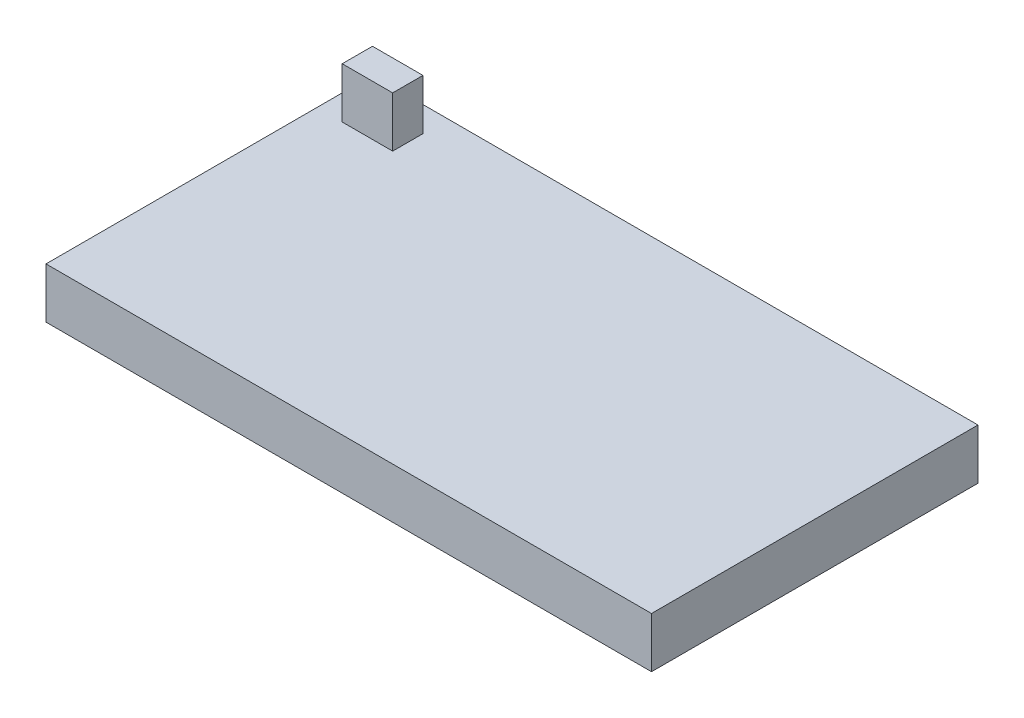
ISO-10303-21;
HEADER;
FILE_DESCRIPTION(('STEP AP214'),'2;1');
FILE_NAME('part.step','',(''),(''),'','','');
FILE_SCHEMA(('AUTOMOTIVE_DESIGN { 1 0 10303 214 1 1 1 1 }'));
ENDSEC;
DATA;
#1=APPLICATION_CONTEXT('core data for automotive mechanical design processes');
#2=APPLICATION_PROTOCOL_DEFINITION('international standard','automotive_design',2000,#1);
#3=PRODUCT_CONTEXT('',#1,'mechanical');
#4=PRODUCT('Part','Part','',(#3));
#5=PRODUCT_RELATED_PRODUCT_CATEGORY('part','',(#4));
#6=PRODUCT_DEFINITION_FORMATION('','',#4);
#7=PRODUCT_DEFINITION_CONTEXT('part definition',#1,'design');
#8=PRODUCT_DEFINITION('design','',#6,#7);
#9=PRODUCT_DEFINITION_SHAPE('','',#8);
#10=(LENGTH_UNIT() NAMED_UNIT(*) SI_UNIT(.MILLI.,.METRE.));
#11=(NAMED_UNIT(*) PLANE_ANGLE_UNIT() SI_UNIT($,.RADIAN.));
#12=(NAMED_UNIT(*) SI_UNIT($,.STERADIAN.) SOLID_ANGLE_UNIT());
#13=UNCERTAINTY_MEASURE_WITH_UNIT(LENGTH_MEASURE(1.E-05),#10,'distance_accuracy_value','');
#14=(GEOMETRIC_REPRESENTATION_CONTEXT(3) GLOBAL_UNCERTAINTY_ASSIGNED_CONTEXT((#13)) GLOBAL_UNIT_ASSIGNED_CONTEXT((#10,
#11,#12)) REPRESENTATION_CONTEXT('',''));
#15=CARTESIAN_POINT('',(0.,0.,0.));
#16=DIRECTION('',(0.,0.,1.));
#17=DIRECTION('',(1.,0.,0.));
#18=AXIS2_PLACEMENT_3D('',#15,#16,#17);
#19=CARTESIAN_POINT('',(-76.2,12.7,44.0729322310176));
#20=DIRECTION('',(0.,1.,0.));
#21=DIRECTION('',(0.,0.,1.));
#22=AXIS2_PLACEMENT_3D('',#19,#20,#21);
#23=PLANE('',#22);
#24=DIRECTION('',(0.,0.,1.));
#25=VECTOR('',#24,1.);
#26=CARTESIAN_POINT('',(-76.2,12.7,-38.1));
#27=LINE('',#26,#25);
#28=CARTESIAN_POINT('',(-76.2,12.7,-38.1));
#29=VERTEX_POINT('',#28);
#30=CARTESIAN_POINT('',(-76.2,12.7,44.0729322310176));
#31=VERTEX_POINT('',#30);
#32=EDGE_CURVE('E139',#29,#31,#27,.T.);
#33=ORIENTED_EDGE('',*,*,#32,.T.);
#34=DIRECTION('',(1.,0.,0.));
#35=VECTOR('',#34,1.);
#36=CARTESIAN_POINT('',(-76.2,12.7,44.0729322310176));
#37=LINE('',#36,#35);
#38=CARTESIAN_POINT('',(76.2,12.7,44.0729322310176));
#39=VERTEX_POINT('',#38);
#40=EDGE_CURVE('E84',#31,#39,#37,.T.);
#41=ORIENTED_EDGE('',*,*,#40,.T.);
#42=DIRECTION('',(0.,0.,-1.));
#43=VECTOR('',#42,1.);
#44=CARTESIAN_POINT('',(76.2,12.7,-38.1));
#45=LINE('',#44,#43);
#46=CARTESIAN_POINT('',(76.2,12.7,-38.1));
#47=VERTEX_POINT('',#46);
#48=EDGE_CURVE('E142',#39,#47,#45,.T.);
#49=ORIENTED_EDGE('',*,*,#48,.T.);
#50=DIRECTION('',(-1.,0.,0.));
#51=VECTOR('',#50,1.);
#52=CARTESIAN_POINT('',(-76.2,12.7,-38.1));
#53=LINE('',#52,#51);
#54=EDGE_CURVE('E56',#47,#29,#53,.T.);
#55=ORIENTED_EDGE('',*,*,#54,.T.);
#56=EDGE_LOOP('',(#33,#41,#49,#55));
#57=FACE_BOUND('',#56,.T.);
#58=DIRECTION('',(1.,0.,0.));
#59=VECTOR('',#58,1.);
#60=CARTESIAN_POINT('',(-69.85,12.7,-24.13));
#61=LINE('',#60,#59);
#62=CARTESIAN_POINT('',(-69.85,12.7,-24.13));
#63=VERTEX_POINT('',#62);
#64=CARTESIAN_POINT('',(-57.15,12.7,-24.13));
#65=VERTEX_POINT('',#64);
#66=EDGE_CURVE('E262',#63,#65,#61,.T.);
#67=ORIENTED_EDGE('',*,*,#66,.F.);
#68=DIRECTION('',(0.,0.,1.));
#69=VECTOR('',#68,1.);
#70=CARTESIAN_POINT('',(-69.85,12.7,-31.75));
#71=LINE('',#70,#69);
#72=CARTESIAN_POINT('',(-69.85,12.7,-31.75));
#73=VERTEX_POINT('',#72);
#74=EDGE_CURVE('E129',#73,#63,#71,.T.);
#75=ORIENTED_EDGE('',*,*,#74,.F.);
#76=DIRECTION('',(-1.,0.,0.));
#77=VECTOR('',#76,1.);
#78=CARTESIAN_POINT('',(-69.85,12.7,-31.75));
#79=LINE('',#78,#77);
#80=CARTESIAN_POINT('',(-57.15,12.7,-31.75));
#81=VERTEX_POINT('',#80);
#82=EDGE_CURVE('E125',#81,#73,#79,.T.);
#83=ORIENTED_EDGE('',*,*,#82,.F.);
#84=DIRECTION('',(0.,0.,-1.));
#85=VECTOR('',#84,1.);
#86=CARTESIAN_POINT('',(-57.15,12.7,-31.75));
#87=LINE('',#86,#85);
#88=EDGE_CURVE('E259',#65,#81,#87,.T.);
#89=ORIENTED_EDGE('',*,*,#88,.F.);
#90=EDGE_LOOP('',(#67,#75,#83,#89));
#91=FACE_BOUND('',#90,.T.);
#92=ADVANCED_FACE('F32',(#57,#91),#23,.T.);
#93=CARTESIAN_POINT('',(-76.2,12.7,-38.1));
#94=DIRECTION('',(1.,0.,0.));
#95=DIRECTION('',(0.,0.,-1.));
#96=AXIS2_PLACEMENT_3D('',#93,#94,#95);
#97=PLANE('',#96);
#98=DIRECTION('',(0.,0.,1.));
#99=VECTOR('',#98,1.);
#100=CARTESIAN_POINT('',(-76.2,0.,-38.1));
#101=LINE('',#100,#99);
#102=CARTESIAN_POINT('',(-76.2,0.,-38.1));
#103=VERTEX_POINT('',#102);
#104=CARTESIAN_POINT('',(-76.2,0.,44.0729322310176));
#105=VERTEX_POINT('',#104);
#106=EDGE_CURVE('E131',#103,#105,#101,.T.);
#107=ORIENTED_EDGE('',*,*,#106,.T.);
#108=DIRECTION('',(0.,-1.,0.));
#109=VECTOR('',#108,1.);
#110=CARTESIAN_POINT('',(-76.2,12.7,44.0729322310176));
#111=LINE('',#110,#109);
#112=EDGE_CURVE('E11',#31,#105,#111,.T.);
#113=ORIENTED_EDGE('',*,*,#112,.F.);
#114=ORIENTED_EDGE('',*,*,#32,.F.);
#115=DIRECTION('',(0.,-1.,0.));
#116=VECTOR('',#115,1.);
#117=CARTESIAN_POINT('',(-76.2,12.7,-38.1));
#118=LINE('',#117,#116);
#119=EDGE_CURVE('E144',#29,#103,#118,.T.);
#120=ORIENTED_EDGE('',*,*,#119,.T.);
#121=EDGE_LOOP('',(#107,#113,#114,#120));
#122=FACE_BOUND('',#121,.T.);
#123=ADVANCED_FACE('F34',(#122),#97,.F.);
#124=CARTESIAN_POINT('',(-76.2,12.7,44.0729322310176));
#125=DIRECTION('',(0.,0.,-1.));
#126=DIRECTION('',(-1.,0.,0.));
#127=AXIS2_PLACEMENT_3D('',#124,#125,#126);
#128=PLANE('',#127);
#129=DIRECTION('',(1.,0.,0.));
#130=VECTOR('',#129,1.);
#131=CARTESIAN_POINT('',(-76.2,0.,44.0729322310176));
#132=LINE('',#131,#130);
#133=CARTESIAN_POINT('',(76.2,0.,44.0729322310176));
#134=VERTEX_POINT('',#133);
#135=EDGE_CURVE('E134',#105,#134,#132,.T.);
#136=ORIENTED_EDGE('',*,*,#135,.T.);
#137=DIRECTION('',(0.,-1.,0.));
#138=VECTOR('',#137,1.);
#139=CARTESIAN_POINT('',(76.2,12.7,44.0729322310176));
#140=LINE('',#139,#138);
#141=EDGE_CURVE('E40',#39,#134,#140,.T.);
#142=ORIENTED_EDGE('',*,*,#141,.F.);
#143=ORIENTED_EDGE('',*,*,#40,.F.);
#144=ORIENTED_EDGE('',*,*,#112,.T.);
#145=EDGE_LOOP('',(#136,#142,#143,#144));
#146=FACE_BOUND('',#145,.T.);
#147=ADVANCED_FACE('F172',(#146),#128,.F.);
#148=CARTESIAN_POINT('',(76.2,12.7,-38.1));
#149=DIRECTION('',(-1.,0.,0.));
#150=DIRECTION('',(0.,0.,1.));
#151=AXIS2_PLACEMENT_3D('',#148,#149,#150);
#152=PLANE('',#151);
#153=DIRECTION('',(0.,0.,-1.));
#154=VECTOR('',#153,1.);
#155=CARTESIAN_POINT('',(76.2,0.,-38.1));
#156=LINE('',#155,#154);
#157=CARTESIAN_POINT('',(76.2,0.,-38.1));
#158=VERTEX_POINT('',#157);
#159=EDGE_CURVE('E147',#134,#158,#156,.T.);
#160=ORIENTED_EDGE('',*,*,#159,.T.);
#161=DIRECTION('',(0.,-1.,0.));
#162=VECTOR('',#161,1.);
#163=CARTESIAN_POINT('',(76.2,12.7,-38.1));
#164=LINE('',#163,#162);
#165=EDGE_CURVE('E151',#47,#158,#164,.T.);
#166=ORIENTED_EDGE('',*,*,#165,.F.);
#167=ORIENTED_EDGE('',*,*,#48,.F.);
#168=ORIENTED_EDGE('',*,*,#141,.T.);
#169=EDGE_LOOP('',(#160,#166,#167,#168));
#170=FACE_BOUND('',#169,.T.);
#171=ADVANCED_FACE('F156',(#170),#152,.F.);
#172=CARTESIAN_POINT('',(-76.2,12.7,-38.1));
#173=DIRECTION('',(0.,0.,1.));
#174=DIRECTION('',(1.,0.,0.));
#175=AXIS2_PLACEMENT_3D('',#172,#173,#174);
#176=PLANE('',#175);
#177=DIRECTION('',(-1.,0.,0.));
#178=VECTOR('',#177,1.);
#179=CARTESIAN_POINT('',(-76.2,0.,-38.1));
#180=LINE('',#179,#178);
#181=EDGE_CURVE('E77',#158,#103,#180,.T.);
#182=ORIENTED_EDGE('',*,*,#181,.T.);
#183=ORIENTED_EDGE('',*,*,#119,.F.);
#184=ORIENTED_EDGE('',*,*,#54,.F.);
#185=ORIENTED_EDGE('',*,*,#165,.T.);
#186=EDGE_LOOP('',(#182,#183,#184,#185));
#187=FACE_BOUND('',#186,.T.);
#188=ADVANCED_FACE('F164',(#187),#176,.F.);
#189=CARTESIAN_POINT('',(-76.2,0.,44.0729322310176));
#190=DIRECTION('',(0.,1.,0.));
#191=DIRECTION('',(0.,0.,1.));
#192=AXIS2_PLACEMENT_3D('',#189,#190,#191);
#193=PLANE('',#192);
#194=ORIENTED_EDGE('',*,*,#106,.F.);
#195=ORIENTED_EDGE('',*,*,#181,.F.);
#196=ORIENTED_EDGE('',*,*,#159,.F.);
#197=ORIENTED_EDGE('',*,*,#135,.F.);
#198=EDGE_LOOP('',(#194,#195,#196,#197));
#199=FACE_BOUND('',#198,.T.);
#200=ADVANCED_FACE('F160',(#199),#193,.F.);
#201=CARTESIAN_POINT('',(-69.85,25.4,-31.75));
#202=DIRECTION('',(1.,0.,0.));
#203=DIRECTION('',(0.,0.,-1.));
#204=AXIS2_PLACEMENT_3D('',#201,#202,#203);
#205=PLANE('',#204);
#206=ORIENTED_EDGE('',*,*,#74,.T.);
#207=DIRECTION('',(0.,-1.,0.));
#208=VECTOR('',#207,1.);
#209=CARTESIAN_POINT('',(-69.85,25.4,-24.13));
#210=LINE('',#209,#208);
#211=CARTESIAN_POINT('',(-69.85,25.4,-24.13));
#212=VERTEX_POINT('',#211);
#213=EDGE_CURVE('E110',#212,#63,#210,.T.);
#214=ORIENTED_EDGE('',*,*,#213,.F.);
#215=DIRECTION('',(0.,0.,1.));
#216=VECTOR('',#215,1.);
#217=CARTESIAN_POINT('',(-69.85,25.4,-31.75));
#218=LINE('',#217,#216);
#219=CARTESIAN_POINT('',(-69.85,25.4,-31.75));
#220=VERTEX_POINT('',#219);
#221=EDGE_CURVE('E117',#220,#212,#218,.T.);
#222=ORIENTED_EDGE('',*,*,#221,.F.);
#223=DIRECTION('',(0.,-1.,0.));
#224=VECTOR('',#223,1.);
#225=CARTESIAN_POINT('',(-69.85,25.4,-31.75));
#226=LINE('',#225,#224);
#227=EDGE_CURVE('E257',#220,#73,#226,.T.);
#228=ORIENTED_EDGE('',*,*,#227,.T.);
#229=EDGE_LOOP('',(#206,#214,#222,#228));
#230=FACE_BOUND('',#229,.T.);
#231=ADVANCED_FACE('F127',(#230),#205,.F.);
#232=CARTESIAN_POINT('',(-69.85,25.4,-24.13));
#233=DIRECTION('',(0.,0.,-1.));
#234=DIRECTION('',(-1.,0.,0.));
#235=AXIS2_PLACEMENT_3D('',#232,#233,#234);
#236=PLANE('',#235);
#237=ORIENTED_EDGE('',*,*,#66,.T.);
#238=DIRECTION('',(0.,-1.,0.));
#239=VECTOR('',#238,1.);
#240=CARTESIAN_POINT('',(-57.15,25.4,-24.13));
#241=LINE('',#240,#239);
#242=CARTESIAN_POINT('',(-57.15,25.4,-24.13));
#243=VERTEX_POINT('',#242);
#244=EDGE_CURVE('E113',#243,#65,#241,.T.);
#245=ORIENTED_EDGE('',*,*,#244,.F.);
#246=DIRECTION('',(1.,0.,0.));
#247=VECTOR('',#246,1.);
#248=CARTESIAN_POINT('',(-69.85,25.4,-24.13));
#249=LINE('',#248,#247);
#250=EDGE_CURVE('E106',#212,#243,#249,.T.);
#251=ORIENTED_EDGE('',*,*,#250,.F.);
#252=ORIENTED_EDGE('',*,*,#213,.T.);
#253=EDGE_LOOP('',(#237,#245,#251,#252));
#254=FACE_BOUND('',#253,.T.);
#255=ADVANCED_FACE('F108',(#254),#236,.F.);
#256=CARTESIAN_POINT('',(-57.15,25.4,-31.75));
#257=DIRECTION('',(-1.,0.,0.));
#258=DIRECTION('',(0.,0.,1.));
#259=AXIS2_PLACEMENT_3D('',#256,#257,#258);
#260=PLANE('',#259);
#261=ORIENTED_EDGE('',*,*,#88,.T.);
#262=DIRECTION('',(0.,-1.,0.));
#263=VECTOR('',#262,1.);
#264=CARTESIAN_POINT('',(-57.15,25.4,-31.75));
#265=LINE('',#264,#263);
#266=CARTESIAN_POINT('',(-57.15,25.4,-31.75));
#267=VERTEX_POINT('',#266);
#268=EDGE_CURVE('E47',#267,#81,#265,.T.);
#269=ORIENTED_EDGE('',*,*,#268,.F.);
#270=DIRECTION('',(0.,0.,-1.));
#271=VECTOR('',#270,1.);
#272=CARTESIAN_POINT('',(-57.15,25.4,-31.75));
#273=LINE('',#272,#271);
#274=EDGE_CURVE('E116',#243,#267,#273,.T.);
#275=ORIENTED_EDGE('',*,*,#274,.F.);
#276=ORIENTED_EDGE('',*,*,#244,.T.);
#277=EDGE_LOOP('',(#261,#269,#275,#276));
#278=FACE_BOUND('',#277,.T.);
#279=ADVANCED_FACE('F185',(#278),#260,.F.);
#280=CARTESIAN_POINT('',(-69.85,25.4,-31.75));
#281=DIRECTION('',(0.,0.,1.));
#282=DIRECTION('',(1.,0.,0.));
#283=AXIS2_PLACEMENT_3D('',#280,#281,#282);
#284=PLANE('',#283);
#285=ORIENTED_EDGE('',*,*,#82,.T.);
#286=ORIENTED_EDGE('',*,*,#227,.F.);
#287=DIRECTION('',(-1.,0.,0.));
#288=VECTOR('',#287,1.);
#289=CARTESIAN_POINT('',(-69.85,25.4,-31.75));
#290=LINE('',#289,#288);
#291=EDGE_CURVE('E121',#267,#220,#290,.T.);
#292=ORIENTED_EDGE('',*,*,#291,.F.);
#293=ORIENTED_EDGE('',*,*,#268,.T.);
#294=EDGE_LOOP('',(#285,#286,#292,#293));
#295=FACE_BOUND('',#294,.T.);
#296=ADVANCED_FACE('F188',(#295),#284,.F.);
#297=CARTESIAN_POINT('',(-69.85,25.4,-24.13));
#298=DIRECTION('',(0.,1.,0.));
#299=DIRECTION('',(0.,0.,1.));
#300=AXIS2_PLACEMENT_3D('',#297,#298,#299);
#301=PLANE('',#300);
#302=ORIENTED_EDGE('',*,*,#221,.T.);
#303=ORIENTED_EDGE('',*,*,#250,.T.);
#304=ORIENTED_EDGE('',*,*,#274,.T.);
#305=ORIENTED_EDGE('',*,*,#291,.T.);
#306=EDGE_LOOP('',(#302,#303,#304,#305));
#307=FACE_BOUND('',#306,.T.);
#308=ADVANCED_FACE('F120',(#307),#301,.T.);
#309=CLOSED_SHELL('',(#92,#123,#147,#171,#188,#200,#231,#255,#279,#296,#308));
#310=MANIFOLD_SOLID_BREP('B2',#309);
#311=ADVANCED_BREP_SHAPE_REPRESENTATION('',(#18,#310),#14);
#312=SHAPE_DEFINITION_REPRESENTATION(#9,#311);
ENDSEC;
END-ISO-10303-21;
